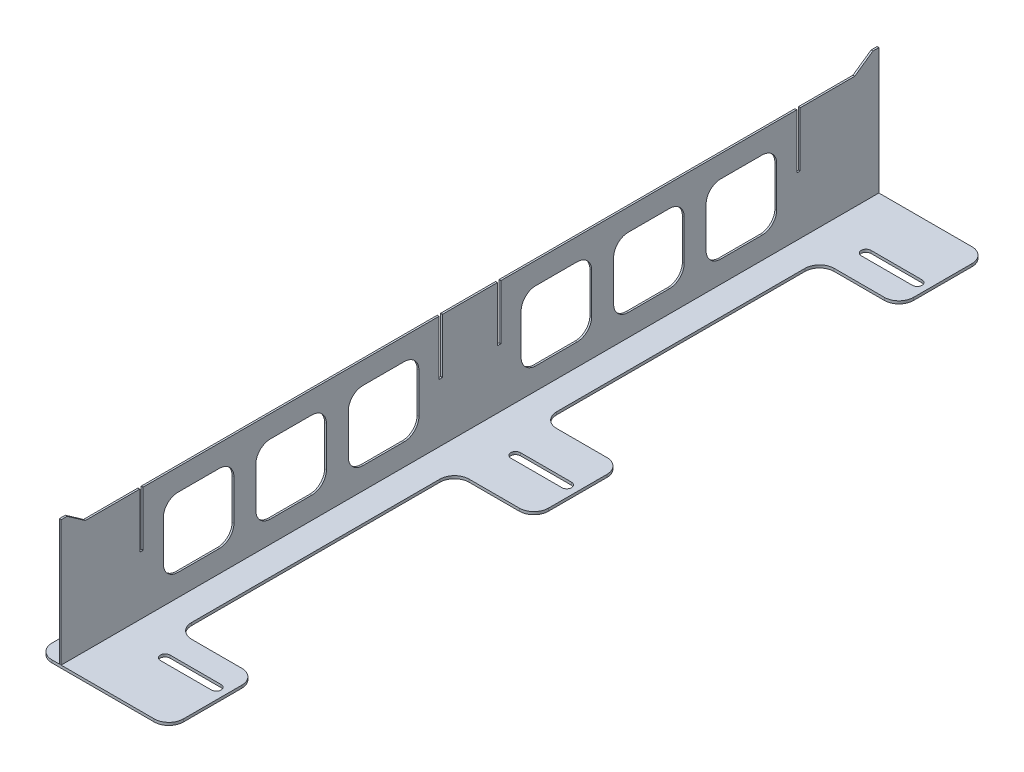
from build123d import *

# Parameters (mm, degrees)
BOSS_EXTRUDE1_DEPTH = 9.525
BOSS_EXTRUDE3_DEPTH = 3.175


with BuildPart() as part:
    # Sketch2 → Boss-Extrude1 (new body)
    with BuildSketch(Plane(origin=(0, 0, 0), x_dir=(1, 0, 0), z_dir=(0, 1, 0))):
        with BuildLine():
            Line((-28.575, 1422.4), (327.025, 1422.4))
            ThreePointArc((327.025, 1422.4), (362.946024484, 1407.521024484), (377.825, 1371.6))
            Line((377.825, 1371.6), (377.825, 1168.4))
            ThreePointArc((377.825, 1168.4), (362.946024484, 1132.478975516), (327.025, 1117.6))
            Line((327.025, 1117.6), (152.4, 1117.6))
            ThreePointArc((152.4, 1117.6), (116.478975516, 1102.721024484), (101.6, 1066.8))
            Line((101.6, 1066.8), (101.6, 203.2))
            ThreePointArc((101.6, 203.2), (116.478975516, 167.278975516), (152.4, 152.4))
            Line((152.4, 152.4), (327.025, 152.4))
            ThreePointArc((327.025, 152.4), (362.946024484, 137.521024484), (377.825, 101.6))
            Line((377.825, 101.6), (377.825, -101.6))
            ThreePointArc((377.825, -101.6), (362.946024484, -137.521024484), (327.025, -152.4))
            Line((327.025, -152.4), (152.4, -152.4))
            ThreePointArc((152.4, -152.4), (116.478975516, -167.278975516), (101.6, -203.2))
            Line((101.6, -203.2), (101.6, -1066.8))
            ThreePointArc((101.6, -1066.8), (116.478975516, -1102.721024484), (152.4, -1117.6))
            Line((152.4, -1117.6), (327.025, -1117.6))
            ThreePointArc((327.025, -1117.6), (362.946024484, -1132.478975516), (377.825, -1168.4))
            Line((377.825, -1168.4), (377.825, -1371.6))
            ThreePointArc((377.825, -1371.6), (362.946024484, -1407.521024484), (327.025, -1422.4))
            Line((327.025, -1422.4), (-28.575, -1422.4))
            ThreePointArc((-28.575, -1422.4), (-64.496024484, -1407.521024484), (-79.375, -1371.6))
            Line((-79.375, -1371.6), (-79.375, 1371.6))
            ThreePointArc((-79.375, 1371.6), (-64.496024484, 1407.521024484), (-28.575, 1422.4))
        make_face()
        with BuildLine():
            Line((161.925, 16.66875), (339.725, 16.66875))
            ThreePointArc((339.725, 16.66875), (356.39375, 0), (339.725, -16.66875))
            Line((339.725, -16.66875), (161.925, -16.66875))
            ThreePointArc((161.925, -16.66875), (145.25625, 0), (161.925, 16.66875))
        make_face(mode=Mode.SUBTRACT)
        with BuildLine():
            Line((161.925, 1202.53125), (339.725, 1202.53125))
            ThreePointArc((339.725, 1202.53125), (356.39375, 1219.2), (339.725, 1235.86875))
            Line((339.725, 1235.86875), (161.925, 1235.86875))
            ThreePointArc((161.925, 1235.86875), (145.25625, 1219.2), (161.925, 1202.53125))
        make_face(mode=Mode.SUBTRACT)
        with BuildLine():
            Line((161.925, -1202.53125), (339.725, -1202.53125))
            ThreePointArc((339.725, -1202.53125), (356.39375, -1219.2), (339.725, -1235.86875))
            Line((339.725, -1235.86875), (161.925, -1235.86875))
            ThreePointArc((161.925, -1235.86875), (145.25625, -1219.2), (161.925, -1202.53125))
        make_face(mode=Mode.SUBTRACT)
    extrude(amount=BOSS_EXTRUDE1_DEPTH)


with BuildPart() as body_2:
    # Sketch4 → Boss-Extrude3 (new, symmetric)
    with BuildSketch(Plane(origin=(0, 0, 0), x_dir=(0, 0, -1), z_dir=(1, 0, 0))):
        with BuildLine():
            Line((-1422.4, 9.525), (1422.4, 9.525))
            Line((1422.4, 9.525), (1422.4, 403.225))
            Line((1422.4, 403.225), (1422.4, 447.675))
            Line((1422.4, 447.675), (1401.7436789, 447.675))
            Line((1401.7436789, 447.675), (1338.2625, 403.225))
            Line((1338.2625, 403.225), (1149.35, 403.225))
            ThreePointArc((1149.35, 403.225), (1148.811184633, 403.001815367), (1148.588, 402.463))
            Line((1148.588, 402.463), (1148.588, 213.487))
            ThreePointArc((1148.588, 213.487), (1148.364815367, 212.948184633), (1147.826, 212.725))
            Line((1147.826, 212.725), (1138.174, 212.725))
            ThreePointArc((1138.174, 212.725), (1137.635184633, 212.948184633), (1137.412, 213.487))
            Line((1137.412, 213.487), (1137.412, 402.463))
            ThreePointArc((1137.412, 402.463), (1137.188815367, 403.001815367), (1136.65, 403.225))
            Line((1136.65, 403.225), (107.95, 403.225))
            ThreePointArc((107.95, 403.225), (107.411184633, 403.001815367), (107.188, 402.463))
            Line((107.188, 402.463), (107.188, 213.487))
            ThreePointArc((107.188, 213.487), (106.964815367, 212.948184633), (106.426, 212.725))
            Line((106.426, 212.725), (96.774, 212.725))
            ThreePointArc((96.774, 212.725), (96.235184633, 212.948184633), (96.012, 213.487))
            Line((96.012, 213.487), (96.012, 402.463))
            ThreePointArc((96.012, 402.463), (95.788815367, 403.001815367), (95.25, 403.225))
            Line((95.25, 403.225), (-95.25, 403.225))
            ThreePointArc((-95.25, 403.225), (-95.788815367, 403.001815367), (-96.012, 402.463))
            Line((-96.012, 402.463), (-96.012, 213.487))
            ThreePointArc((-96.012, 213.487), (-96.235184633, 212.948184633), (-96.774, 212.725))
            Line((-96.774, 212.725), (-106.426, 212.725))
            ThreePointArc((-106.426, 212.725), (-106.964815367, 212.948184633), (-107.188, 213.487))
            Line((-107.188, 213.487), (-107.188, 402.463))
            ThreePointArc((-107.188, 402.463), (-107.411184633, 403.001815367), (-107.95, 403.225))
            Line((-107.95, 403.225), (-1136.65, 403.225))
            ThreePointArc((-1136.65, 403.225), (-1137.188815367, 403.001815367), (-1137.412, 402.463))
            Line((-1137.412, 402.463), (-1137.412, 213.487))
            ThreePointArc((-1137.412, 213.487), (-1137.635184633, 212.948184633), (-1138.174, 212.725))
            Line((-1138.174, 212.725), (-1147.826, 212.725))
            ThreePointArc((-1147.826, 212.725), (-1148.364815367, 212.948184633), (-1148.588, 213.487))
            Line((-1148.588, 213.487), (-1148.588, 402.463))
            ThreePointArc((-1148.588, 402.463), (-1148.811184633, 403.001815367), (-1149.35, 403.225))
            Line((-1149.35, 403.225), (-1338.2625, 403.225))
            Line((-1338.2625, 403.225), (-1401.7436789, 447.675))
            Line((-1401.7436789, 447.675), (-1422.4, 447.675))
            Line((-1422.4, 447.675), (-1422.4, 403.225))
            Line((-1422.4, 403.225), (-1422.4, 9.525))
        make_face()
        with BuildLine():
            Line((177.8, 276.225), (177.8, 136.525))
            ThreePointArc((177.8, 136.525), (192.678975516, 100.603975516), (228.6, 85.725))
            Line((228.6, 85.725), (372.533333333, 85.725))
            ThreePointArc((372.533333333, 85.725), (408.454357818, 100.603975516), (423.333333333, 136.525))
            Line((423.333333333, 136.525), (423.333333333, 276.225))
            ThreePointArc((423.333333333, 276.225), (408.454357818, 312.146024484), (372.533333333, 327.025))
            Line((372.533333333, 327.025), (228.6, 327.025))
            ThreePointArc((228.6, 327.025), (192.678975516, 312.146024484), (177.8, 276.225))
        make_face(mode=Mode.SUBTRACT)
        with BuildLine():
            Line((-1016, 327.025), (-872.066666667, 327.025))
            ThreePointArc((-872.066666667, 327.025), (-836.145642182, 312.146024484), (-821.266666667, 276.225))
            Line((-821.266666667, 276.225), (-821.266666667, 136.525))
            ThreePointArc((-821.266666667, 136.525), (-836.145642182, 100.603975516), (-872.066666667, 85.725))
            Line((-872.066666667, 85.725), (-1016, 85.725))
            ThreePointArc((-1016, 85.725), (-1051.921024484, 100.603975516), (-1066.8, 136.525))
            Line((-1066.8, 136.525), (-1066.8, 276.225))
            ThreePointArc((-1066.8, 276.225), (-1051.921024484, 312.146024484), (-1016, 327.025))
        make_face(mode=Mode.SUBTRACT)
        with BuildLine():
            Line((-694.266666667, 327.025), (-550.333333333, 327.025))
            ThreePointArc((-550.333333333, 327.025), (-514.412308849, 312.146024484), (-499.533333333, 276.225))
            Line((-499.533333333, 276.225), (-499.533333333, 136.525))
            ThreePointArc((-499.533333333, 136.525), (-514.412308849, 100.603975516), (-550.333333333, 85.725))
            Line((-550.333333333, 85.725), (-694.266666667, 85.725))
            ThreePointArc((-694.266666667, 85.725), (-730.187691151, 100.603975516), (-745.066666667, 136.525))
            Line((-745.066666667, 136.525), (-745.066666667, 276.225))
            ThreePointArc((-745.066666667, 276.225), (-730.187691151, 312.146024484), (-694.266666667, 327.025))
        make_face(mode=Mode.SUBTRACT)
        with BuildLine():
            Line((-372.533333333, 327.025), (-228.6, 327.025))
            ThreePointArc((-228.6, 327.025), (-192.678975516, 312.146024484), (-177.8, 276.225))
            Line((-177.8, 276.225), (-177.8, 136.525))
            ThreePointArc((-177.8, 136.525), (-192.678975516, 100.603975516), (-228.6, 85.725))
            Line((-228.6, 85.725), (-372.533333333, 85.725))
            ThreePointArc((-372.533333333, 85.725), (-408.454357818, 100.603975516), (-423.333333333, 136.525))
            Line((-423.333333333, 136.525), (-423.333333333, 276.225))
            ThreePointArc((-423.333333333, 276.225), (-408.454357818, 312.146024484), (-372.533333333, 327.025))
        make_face(mode=Mode.SUBTRACT)
        with BuildLine():
            Line((499.533333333, 276.225), (499.533333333, 136.525))
            ThreePointArc((499.533333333, 136.525), (514.412308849, 100.603975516), (550.333333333, 85.725))
            Line((550.333333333, 85.725), (694.266666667, 85.725))
            ThreePointArc((694.266666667, 85.725), (730.187691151, 100.603975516), (745.066666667, 136.525))
            Line((745.066666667, 136.525), (745.066666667, 276.225))
            ThreePointArc((745.066666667, 276.225), (730.187691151, 312.146024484), (694.266666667, 327.025))
            Line((694.266666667, 327.025), (550.333333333, 327.025))
            ThreePointArc((550.333333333, 327.025), (514.412308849, 312.146024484), (499.533333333, 276.225))
        make_face(mode=Mode.SUBTRACT)
        with BuildLine():
            Line((821.266666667, 276.225), (821.266666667, 136.525))
            ThreePointArc((821.266666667, 136.525), (836.145642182, 100.603975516), (872.066666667, 85.725))
            Line((872.066666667, 85.725), (1016, 85.725))
            ThreePointArc((1016, 85.725), (1051.921024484, 100.603975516), (1066.8, 136.525))
            Line((1066.8, 136.525), (1066.8, 276.225))
            ThreePointArc((1066.8, 276.225), (1051.921024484, 312.146024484), (1016, 327.025))
            Line((1016, 327.025), (872.066666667, 327.025))
            ThreePointArc((872.066666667, 327.025), (836.145642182, 312.146024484), (821.266666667, 276.225))
        make_face(mode=Mode.SUBTRACT)
    extrude(amount=BOSS_EXTRUDE3_DEPTH, both=True)


solid = Compound([part.part, body_2.part])
